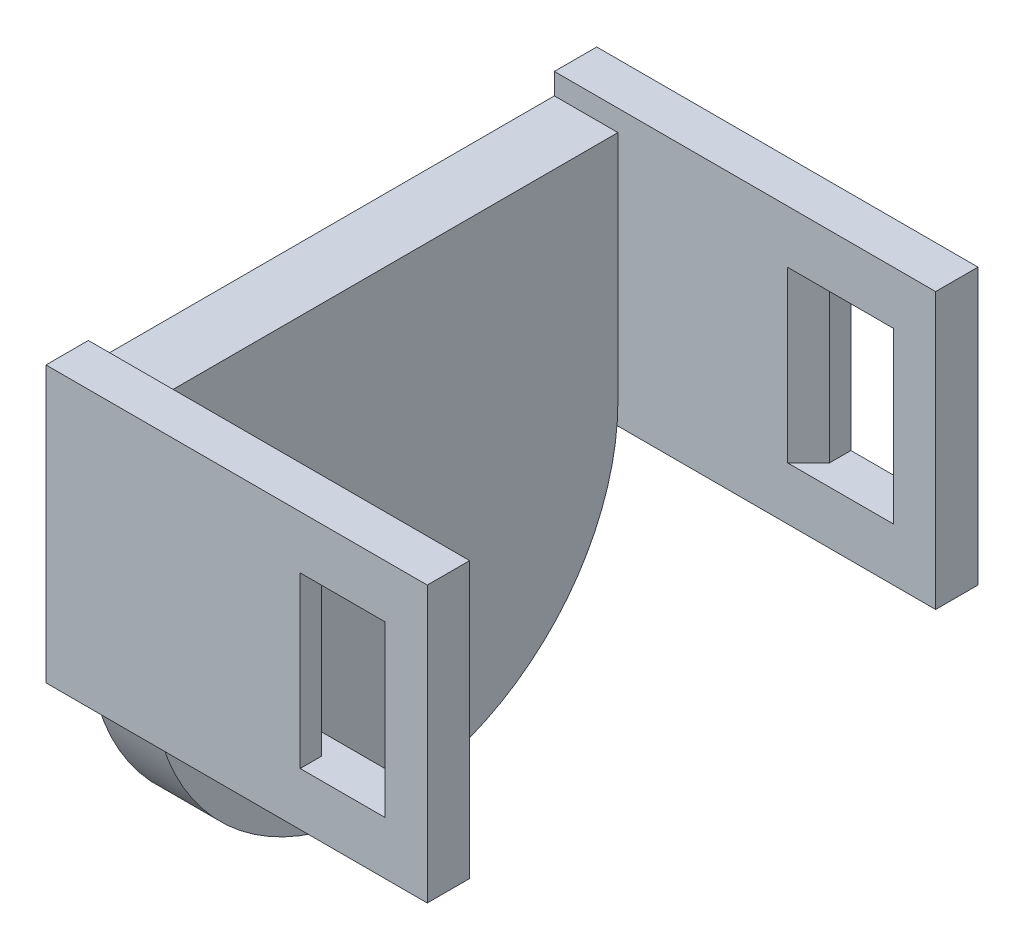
from build123d import *

# Parameters (mm, degrees)
BOSS_EXTRUDE5_DEPTH  = 3
SKETCH9_W            = 3
SKETCH9_H            = 11
BOSS_EXTRUDE6_DEPTH  = 2
SKETCH12_W           = 3
SKETCH12_H           = 11
BOSS_EXTRUDE8_DEPTH  = 2
SKETCH14_W           = 3
SKETCH14_H           = 2
BOSS_EXTRUDE12_DEPTH = 1
SKETCH15_W           = 3
SKETCH15_H           = 2
BOSS_EXTRUDE13_DEPTH = 1
SKETCH16_W           = 3
SKETCH16_H           = 2
BOSS_EXTRUDE14_DEPTH = 1
SKETCH17_W           = 3
SKETCH17_H           = 2
BOSS_EXTRUDE15_DEPTH = 1
SKETCH18_W           = 2
SKETCH18_H           = 13
BOSS_EXTRUDE16_DEPTH = 15
SKETCH19_W           = 2
SKETCH19_H           = 13
BOSS_EXTRUDE17_DEPTH = 15
SKETCH20_W           = 4
SKETCH20_H           = 8
CUT_EXTRUDE1_DEPTH   = 34.823069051
CHAMFER2_SIZE        = 1
CHAMFER3_SIZE        = 1


with BuildPart() as part:
    # Sketch1 → Boss-Extrude5 (new body)
    with BuildSketch(Plane(origin=(0, 0, 0), x_dir=(0, 0, -1), z_dir=(1, 0, 0))):
        with BuildLine():
            Line((-11, 0), (-11, 11))
            Line((-11, 11), (11, 11))
            Line((11, 11), (11, 0))
            ThreePointArc((11, 0), (0, -11), (-11, 0))
        make_face()
    extrude(amount=BOSS_EXTRUDE5_DEPTH)

    # Sketch9 → Boss-Extrude6 (add)
    with BuildSketch(Plane.XY.offset(11)):
        with Locations((1.5, 5.5)):
            Rectangle(SKETCH9_W, SKETCH9_H)
    extrude(amount=BOSS_EXTRUDE6_DEPTH)

    # Sketch12 → Boss-Extrude8 (add)
    with BuildSketch(Plane(origin=(0, 0, -11), x_dir=(-1, 0, 0), z_dir=(0, 0, -1))):
        with Locations((-1.5, 5.5)):
            Rectangle(SKETCH12_W, SKETCH12_H)
    extrude(amount=BOSS_EXTRUDE8_DEPTH)

    # Sketch14 → Boss-Extrude12 (add)
    with BuildSketch(Plane(origin=(0, 11, 0), x_dir=(1, 0, 0), z_dir=(0, 1, 0))):
        with Locations((1.5, -12)):
            Rectangle(SKETCH14_W, SKETCH14_H)
    extrude(amount=BOSS_EXTRUDE12_DEPTH)

    # Sketch15 → Boss-Extrude13 (add)
    with BuildSketch(Plane(origin=(0, 11, 0), x_dir=(1, 0, 0), z_dir=(0, 1, 0))):
        with Locations((1.5, 12)):
            Rectangle(SKETCH15_W, SKETCH15_H)
    extrude(amount=BOSS_EXTRUDE13_DEPTH)

    # Sketch16 → Boss-Extrude14 (add)
    with BuildSketch(Plane.XZ):
        with Locations((1.5, -12)):
            Rectangle(SKETCH16_W, SKETCH16_H)
    extrude(amount=BOSS_EXTRUDE14_DEPTH)

    # Sketch17 → Boss-Extrude15 (add)
    with BuildSketch(Plane.XZ):
        with Locations((1.5, 12)):
            Rectangle(SKETCH17_W, SKETCH17_H)
    extrude(amount=BOSS_EXTRUDE15_DEPTH)

    # Sketch18 → Boss-Extrude16 (add)
    with BuildSketch(Plane(origin=(3, 0, 0), x_dir=(0, 0, -1), z_dir=(1, 0, 0))):
        with Locations((-12, 5.5)):
            Rectangle(SKETCH18_W, SKETCH18_H)
    extrude(amount=BOSS_EXTRUDE16_DEPTH)

    # Sketch19 → Boss-Extrude17 (add)
    with BuildSketch(Plane(origin=(3, 0, 0), x_dir=(0, 0, -1), z_dir=(1, 0, 0))):
        with Locations((12, 5.5)):
            Rectangle(SKETCH19_W, SKETCH19_H)
    extrude(amount=BOSS_EXTRUDE17_DEPTH)

    # Sketch20 → Cut-Extrude1 (cut, through all)
    with BuildSketch(Plane.XY.offset(13)):
        with Locations((14, 5.5)):
            Rectangle(SKETCH20_W, SKETCH20_H)
    extrude(amount=-CUT_EXTRUDE1_DEPTH, mode=Mode.SUBTRACT)

    # Chamfer2
    chamfer2_edges = [part.edges().sort_by_distance(p)[0] for p in [
        (12, 5.5, -11),
    ]]
    chamfer(chamfer2_edges, length=CHAMFER2_SIZE)

    # Chamfer3
    chamfer3_edges = [part.edges().sort_by_distance(p)[0] for p in [
        (12, 5.5, 11),
    ]]
    chamfer(chamfer3_edges, length=CHAMFER3_SIZE)


solid = part.part
